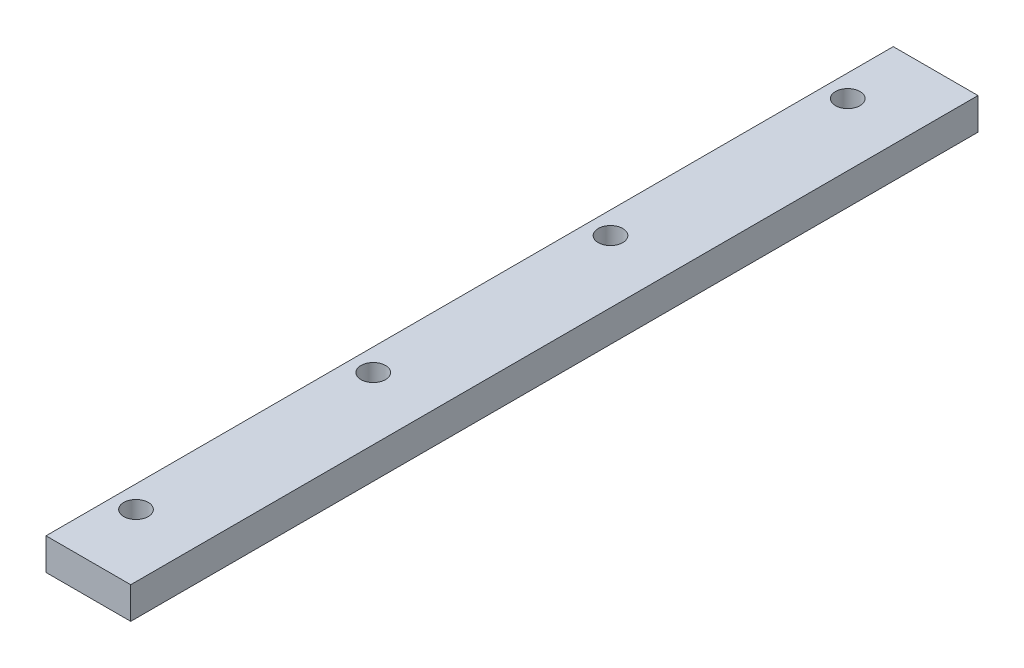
ISO-10303-21;
HEADER;
FILE_DESCRIPTION(('STEP AP214'),'2;1');
FILE_NAME('part.step','',(''),(''),'','','');
FILE_SCHEMA(('AUTOMOTIVE_DESIGN { 1 0 10303 214 1 1 1 1 }'));
ENDSEC;
DATA;
#1=APPLICATION_CONTEXT('core data for automotive mechanical design processes');
#2=APPLICATION_PROTOCOL_DEFINITION('international standard','automotive_design',2000,#1);
#3=PRODUCT_CONTEXT('',#1,'mechanical');
#4=PRODUCT('Part','Part','',(#3));
#5=PRODUCT_RELATED_PRODUCT_CATEGORY('part','',(#4));
#6=PRODUCT_DEFINITION_FORMATION('','',#4);
#7=PRODUCT_DEFINITION_CONTEXT('part definition',#1,'design');
#8=PRODUCT_DEFINITION('design','',#6,#7);
#9=PRODUCT_DEFINITION_SHAPE('','',#8);
#10=(LENGTH_UNIT() NAMED_UNIT(*) SI_UNIT(.MILLI.,.METRE.));
#11=(NAMED_UNIT(*) PLANE_ANGLE_UNIT() SI_UNIT($,.RADIAN.));
#12=(NAMED_UNIT(*) SI_UNIT($,.STERADIAN.) SOLID_ANGLE_UNIT());
#13=UNCERTAINTY_MEASURE_WITH_UNIT(LENGTH_MEASURE(1.E-05),#10,'distance_accuracy_value','');
#14=(GEOMETRIC_REPRESENTATION_CONTEXT(3) GLOBAL_UNCERTAINTY_ASSIGNED_CONTEXT((#13)) GLOBAL_UNIT_ASSIGNED_CONTEXT((#10,
#11,#12)) REPRESENTATION_CONTEXT('',''));
#15=CARTESIAN_POINT('',(0.,0.,0.));
#16=DIRECTION('',(0.,0.,1.));
#17=DIRECTION('',(1.,0.,0.));
#18=AXIS2_PLACEMENT_3D('',#15,#16,#17);
#19=CARTESIAN_POINT('',(-5.31700015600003,0.,101.6));
#20=DIRECTION('',(0.,1.,0.));
#21=DIRECTION('',(0.,0.,1.));
#22=AXIS2_PLACEMENT_3D('',#19,#20,#21);
#23=PLANE('',#22);
#24=CARTESIAN_POINT('',(-2.65000015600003,0.,8.128));
#25=DIRECTION('',(0.,1.,0.));
#26=DIRECTION('',(0.,0.,1.));
#27=AXIS2_PLACEMENT_3D('',#24,#25,#26);
#28=CIRCLE('',#27,1.4732);
#29=CARTESIAN_POINT('',(-2.65000015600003,0.,9.6012));
#30=VERTEX_POINT('',#29);
#31=EDGE_CURVE('E129',#30,#30,#28,.T.);
#32=ORIENTED_EDGE('',*,*,#31,.T.);
#33=EDGE_LOOP('',(#32));
#34=FACE_BOUND('',#33,.T.);
#35=CARTESIAN_POINT('',(-2.65000015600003,0.,36.576));
#36=DIRECTION('',(0.,1.,0.));
#37=DIRECTION('',(0.,0.,1.));
#38=AXIS2_PLACEMENT_3D('',#35,#36,#37);
#39=CIRCLE('',#38,1.4732);
#40=CARTESIAN_POINT('',(-2.65000015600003,0.,38.0492));
#41=VERTEX_POINT('',#40);
#42=EDGE_CURVE('E133',#41,#41,#39,.T.);
#43=ORIENTED_EDGE('',*,*,#42,.T.);
#44=EDGE_LOOP('',(#43));
#45=FACE_BOUND('',#44,.T.);
#46=CARTESIAN_POINT('',(-2.65000015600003,0.,65.024));
#47=DIRECTION('',(0.,1.,0.));
#48=DIRECTION('',(0.,0.,1.));
#49=AXIS2_PLACEMENT_3D('',#46,#47,#48);
#50=CIRCLE('',#49,1.4732);
#51=CARTESIAN_POINT('',(-2.65000015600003,0.,66.4972));
#52=VERTEX_POINT('',#51);
#53=EDGE_CURVE('E137',#52,#52,#50,.T.);
#54=ORIENTED_EDGE('',*,*,#53,.T.);
#55=EDGE_LOOP('',(#54));
#56=FACE_BOUND('',#55,.T.);
#57=CARTESIAN_POINT('',(-2.65000015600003,0.,93.472));
#58=DIRECTION('',(0.,1.,0.));
#59=DIRECTION('',(0.,0.,1.));
#60=AXIS2_PLACEMENT_3D('',#57,#58,#59);
#61=CIRCLE('',#60,1.4732);
#62=CARTESIAN_POINT('',(-2.65000015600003,0.,94.9452));
#63=VERTEX_POINT('',#62);
#64=EDGE_CURVE('E92',#63,#63,#61,.T.);
#65=ORIENTED_EDGE('',*,*,#64,.T.);
#66=EDGE_LOOP('',(#65));
#67=FACE_BOUND('',#66,.T.);
#68=DIRECTION('',(1.,0.,0.));
#69=VECTOR('',#68,1.);
#70=CARTESIAN_POINT('',(-5.31700015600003,0.,0.));
#71=LINE('',#70,#69);
#72=CARTESIAN_POINT('',(-5.31700015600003,0.,0.));
#73=VERTEX_POINT('',#72);
#74=CARTESIAN_POINT('',(4.84299984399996,0.,0.));
#75=VERTEX_POINT('',#74);
#76=EDGE_CURVE('E76',#73,#75,#71,.T.);
#77=ORIENTED_EDGE('',*,*,#76,.T.);
#78=DIRECTION('',(0.,0.,-1.));
#79=VECTOR('',#78,1.);
#80=CARTESIAN_POINT('',(4.84299984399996,0.,101.6));
#81=LINE('',#80,#79);
#82=CARTESIAN_POINT('',(4.84299984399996,0.,101.6));
#83=VERTEX_POINT('',#82);
#84=EDGE_CURVE('E11',#83,#75,#81,.T.);
#85=ORIENTED_EDGE('',*,*,#84,.F.);
#86=DIRECTION('',(1.,0.,0.));
#87=VECTOR('',#86,1.);
#88=CARTESIAN_POINT('',(-5.31700015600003,0.,101.6));
#89=LINE('',#88,#87);
#90=CARTESIAN_POINT('',(-5.31700015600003,0.,101.6));
#91=VERTEX_POINT('',#90);
#92=EDGE_CURVE('E99',#91,#83,#89,.T.);
#93=ORIENTED_EDGE('',*,*,#92,.F.);
#94=DIRECTION('',(0.,0.,-1.));
#95=VECTOR('',#94,1.);
#96=CARTESIAN_POINT('',(-5.31700015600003,0.,101.6));
#97=LINE('',#96,#95);
#98=EDGE_CURVE('E88',#91,#73,#97,.T.);
#99=ORIENTED_EDGE('',*,*,#98,.T.);
#100=EDGE_LOOP('',(#77,#85,#93,#99));
#101=FACE_BOUND('',#100,.T.);
#102=ADVANCED_FACE('F32',(#34,#45,#56,#67,#101),#23,.F.);
#103=CARTESIAN_POINT('',(4.84299984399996,0.,101.6));
#104=DIRECTION('',(-1.,0.,0.));
#105=DIRECTION('',(0.,0.,1.));
#106=AXIS2_PLACEMENT_3D('',#103,#104,#105);
#107=PLANE('',#106);
#108=DIRECTION('',(0.,1.,0.));
#109=VECTOR('',#108,1.);
#110=CARTESIAN_POINT('',(4.84299984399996,0.,0.));
#111=LINE('',#110,#109);
#112=CARTESIAN_POINT('',(4.84299984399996,3.81,0.));
#113=VERTEX_POINT('',#112);
#114=EDGE_CURVE('E72',#75,#113,#111,.T.);
#115=ORIENTED_EDGE('',*,*,#114,.T.);
#116=DIRECTION('',(0.,0.,-1.));
#117=VECTOR('',#116,1.);
#118=CARTESIAN_POINT('',(4.84299984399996,3.81,101.6));
#119=LINE('',#118,#117);
#120=CARTESIAN_POINT('',(4.84299984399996,3.81,101.6));
#121=VERTEX_POINT('',#120);
#122=EDGE_CURVE('E39',#121,#113,#119,.T.);
#123=ORIENTED_EDGE('',*,*,#122,.F.);
#124=DIRECTION('',(0.,1.,0.));
#125=VECTOR('',#124,1.);
#126=CARTESIAN_POINT('',(4.84299984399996,0.,101.6));
#127=LINE('',#126,#125);
#128=EDGE_CURVE('E84',#83,#121,#127,.T.);
#129=ORIENTED_EDGE('',*,*,#128,.F.);
#130=ORIENTED_EDGE('',*,*,#84,.T.);
#131=EDGE_LOOP('',(#115,#123,#129,#130));
#132=FACE_BOUND('',#131,.T.);
#133=ADVANCED_FACE('F83',(#132),#107,.F.);
#134=CARTESIAN_POINT('',(4.84299984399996,3.81,101.6));
#135=DIRECTION('',(0.,-1.,0.));
#136=DIRECTION('',(1.,0.,0.));
#137=AXIS2_PLACEMENT_3D('',#134,#135,#136);
#138=PLANE('',#137);
#139=CARTESIAN_POINT('',(-2.65000015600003,3.81,8.128));
#140=DIRECTION('',(0.,1.,0.));
#141=DIRECTION('',(0.,0.,1.));
#142=AXIS2_PLACEMENT_3D('',#139,#140,#141);
#143=CIRCLE('',#142,1.4732);
#144=CARTESIAN_POINT('',(-2.65000015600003,3.81,9.6012));
#145=VERTEX_POINT('',#144);
#146=EDGE_CURVE('E150',#145,#145,#143,.T.);
#147=ORIENTED_EDGE('',*,*,#146,.F.);
#148=EDGE_LOOP('',(#147));
#149=FACE_BOUND('',#148,.T.);
#150=CARTESIAN_POINT('',(-2.65000015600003,3.81,36.576));
#151=DIRECTION('',(0.,1.,0.));
#152=DIRECTION('',(0.,0.,1.));
#153=AXIS2_PLACEMENT_3D('',#150,#151,#152);
#154=CIRCLE('',#153,1.4732);
#155=CARTESIAN_POINT('',(-2.65000015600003,3.81,38.0492));
#156=VERTEX_POINT('',#155);
#157=EDGE_CURVE('E146',#156,#156,#154,.T.);
#158=ORIENTED_EDGE('',*,*,#157,.F.);
#159=EDGE_LOOP('',(#158));
#160=FACE_BOUND('',#159,.T.);
#161=CARTESIAN_POINT('',(-2.65000015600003,3.81,65.024));
#162=DIRECTION('',(0.,1.,0.));
#163=DIRECTION('',(0.,0.,1.));
#164=AXIS2_PLACEMENT_3D('',#161,#162,#163);
#165=CIRCLE('',#164,1.4732);
#166=CARTESIAN_POINT('',(-2.65000015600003,3.81,66.4972));
#167=VERTEX_POINT('',#166);
#168=EDGE_CURVE('E141',#167,#167,#165,.T.);
#169=ORIENTED_EDGE('',*,*,#168,.F.);
#170=EDGE_LOOP('',(#169));
#171=FACE_BOUND('',#170,.T.);
#172=CARTESIAN_POINT('',(-2.65000015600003,3.81,93.472));
#173=DIRECTION('',(0.,1.,0.));
#174=DIRECTION('',(0.,0.,1.));
#175=AXIS2_PLACEMENT_3D('',#172,#173,#174);
#176=CIRCLE('',#175,1.4732);
#177=CARTESIAN_POINT('',(-2.65000015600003,3.81,94.9452));
#178=VERTEX_POINT('',#177);
#179=EDGE_CURVE('E89',#178,#178,#176,.T.);
#180=ORIENTED_EDGE('',*,*,#179,.F.);
#181=EDGE_LOOP('',(#180));
#182=FACE_BOUND('',#181,.T.);
#183=DIRECTION('',(-1.,0.,0.));
#184=VECTOR('',#183,1.);
#185=CARTESIAN_POINT('',(4.84299984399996,3.81,0.));
#186=LINE('',#185,#184);
#187=CARTESIAN_POINT('',(-5.31700015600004,3.81,0.));
#188=VERTEX_POINT('',#187);
#189=EDGE_CURVE('E77',#113,#188,#186,.T.);
#190=ORIENTED_EDGE('',*,*,#189,.T.);
#191=DIRECTION('',(0.,0.,-1.));
#192=VECTOR('',#191,1.);
#193=CARTESIAN_POINT('',(-5.31700015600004,3.81,101.6));
#194=LINE('',#193,#192);
#195=CARTESIAN_POINT('',(-5.31700015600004,3.81,101.6));
#196=VERTEX_POINT('',#195);
#197=EDGE_CURVE('E105',#196,#188,#194,.T.);
#198=ORIENTED_EDGE('',*,*,#197,.F.);
#199=DIRECTION('',(-1.,0.,0.));
#200=VECTOR('',#199,1.);
#201=CARTESIAN_POINT('',(4.84299984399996,3.81,101.6));
#202=LINE('',#201,#200);
#203=EDGE_CURVE('E51',#121,#196,#202,.T.);
#204=ORIENTED_EDGE('',*,*,#203,.F.);
#205=ORIENTED_EDGE('',*,*,#122,.T.);
#206=EDGE_LOOP('',(#190,#198,#204,#205));
#207=FACE_BOUND('',#206,.T.);
#208=ADVANCED_FACE('F108',(#149,#160,#171,#182,#207),#138,.F.);
#209=CARTESIAN_POINT('',(-5.31700015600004,3.81,101.6));
#210=DIRECTION('',(1.,0.,0.));
#211=DIRECTION('',(0.,1.,0.));
#212=AXIS2_PLACEMENT_3D('',#209,#210,#211);
#213=PLANE('',#212);
#214=DIRECTION('',(0.,-1.,0.));
#215=VECTOR('',#214,1.);
#216=CARTESIAN_POINT('',(-5.31700015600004,3.81,0.));
#217=LINE('',#216,#215);
#218=EDGE_CURVE('E97',#188,#73,#217,.T.);
#219=ORIENTED_EDGE('',*,*,#218,.T.);
#220=ORIENTED_EDGE('',*,*,#98,.F.);
#221=DIRECTION('',(0.,-1.,0.));
#222=VECTOR('',#221,1.);
#223=CARTESIAN_POINT('',(-5.31700015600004,3.81,101.6));
#224=LINE('',#223,#222);
#225=EDGE_CURVE('E46',#196,#91,#224,.T.);
#226=ORIENTED_EDGE('',*,*,#225,.F.);
#227=ORIENTED_EDGE('',*,*,#197,.T.);
#228=EDGE_LOOP('',(#219,#220,#226,#227));
#229=FACE_BOUND('',#228,.T.);
#230=ADVANCED_FACE('F110',(#229),#213,.F.);
#231=CARTESIAN_POINT('',(4.84299984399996,0.,101.6));
#232=DIRECTION('',(0.,0.,1.));
#233=DIRECTION('',(1.,0.,0.));
#234=AXIS2_PLACEMENT_3D('',#231,#232,#233);
#235=PLANE('',#234);
#236=ORIENTED_EDGE('',*,*,#92,.T.);
#237=ORIENTED_EDGE('',*,*,#128,.T.);
#238=ORIENTED_EDGE('',*,*,#203,.T.);
#239=ORIENTED_EDGE('',*,*,#225,.T.);
#240=EDGE_LOOP('',(#236,#237,#238,#239));
#241=FACE_BOUND('',#240,.T.);
#242=ADVANCED_FACE('F111',(#241),#235,.T.);
#243=CARTESIAN_POINT('',(4.84299984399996,0.,0.));
#244=DIRECTION('',(0.,0.,1.));
#245=DIRECTION('',(1.,0.,0.));
#246=AXIS2_PLACEMENT_3D('',#243,#244,#245);
#247=PLANE('',#246);
#248=ORIENTED_EDGE('',*,*,#76,.F.);
#249=ORIENTED_EDGE('',*,*,#218,.F.);
#250=ORIENTED_EDGE('',*,*,#189,.F.);
#251=ORIENTED_EDGE('',*,*,#114,.F.);
#252=EDGE_LOOP('',(#248,#249,#250,#251));
#253=FACE_BOUND('',#252,.T.);
#254=ADVANCED_FACE('F73',(#253),#247,.F.);
#255=CARTESIAN_POINT('',(-2.65000015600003,3.81,93.472));
#256=DIRECTION('',(0.,1.,0.));
#257=DIRECTION('',(0.,0.,1.));
#258=AXIS2_PLACEMENT_3D('',#255,#256,#257);
#259=CYLINDRICAL_SURFACE('',#258,1.4732);
#260=ORIENTED_EDGE('',*,*,#64,.F.);
#261=EDGE_LOOP('',(#260));
#262=FACE_BOUND('',#261,.T.);
#263=ORIENTED_EDGE('',*,*,#179,.T.);
#264=EDGE_LOOP('',(#263));
#265=FACE_BOUND('',#264,.T.);
#266=ADVANCED_FACE('F118',(#262,#265),#259,.F.);
#267=CARTESIAN_POINT('',(-2.65000015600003,3.81,65.024));
#268=DIRECTION('',(0.,1.,0.));
#269=DIRECTION('',(0.,0.,1.));
#270=AXIS2_PLACEMENT_3D('',#267,#268,#269);
#271=CYLINDRICAL_SURFACE('',#270,1.4732);
#272=ORIENTED_EDGE('',*,*,#53,.F.);
#273=EDGE_LOOP('',(#272));
#274=FACE_BOUND('',#273,.T.);
#275=ORIENTED_EDGE('',*,*,#168,.T.);
#276=EDGE_LOOP('',(#275));
#277=FACE_BOUND('',#276,.T.);
#278=ADVANCED_FACE('F167',(#274,#277),#271,.F.);
#279=CARTESIAN_POINT('',(-2.65000015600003,3.81,36.576));
#280=DIRECTION('',(0.,1.,0.));
#281=DIRECTION('',(0.,0.,1.));
#282=AXIS2_PLACEMENT_3D('',#279,#280,#281);
#283=CYLINDRICAL_SURFACE('',#282,1.4732);
#284=ORIENTED_EDGE('',*,*,#42,.F.);
#285=EDGE_LOOP('',(#284));
#286=FACE_BOUND('',#285,.T.);
#287=ORIENTED_EDGE('',*,*,#157,.T.);
#288=EDGE_LOOP('',(#287));
#289=FACE_BOUND('',#288,.T.);
#290=ADVANCED_FACE('F172',(#286,#289),#283,.F.);
#291=CARTESIAN_POINT('',(-2.65000015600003,3.81,8.128));
#292=DIRECTION('',(0.,1.,0.));
#293=DIRECTION('',(0.,0.,1.));
#294=AXIS2_PLACEMENT_3D('',#291,#292,#293);
#295=CYLINDRICAL_SURFACE('',#294,1.4732);
#296=ORIENTED_EDGE('',*,*,#31,.F.);
#297=EDGE_LOOP('',(#296));
#298=FACE_BOUND('',#297,.T.);
#299=ORIENTED_EDGE('',*,*,#146,.T.);
#300=EDGE_LOOP('',(#299));
#301=FACE_BOUND('',#300,.T.);
#302=ADVANCED_FACE('F155',(#298,#301),#295,.F.);
#303=CLOSED_SHELL('',(#102,#133,#208,#230,#242,#254,#266,#278,#290,#302));
#304=MANIFOLD_SOLID_BREP('B2',#303);
#305=ADVANCED_BREP_SHAPE_REPRESENTATION('',(#18,#304),#14);
#306=SHAPE_DEFINITION_REPRESENTATION(#9,#305);
ENDSEC;
END-ISO-10303-21;
